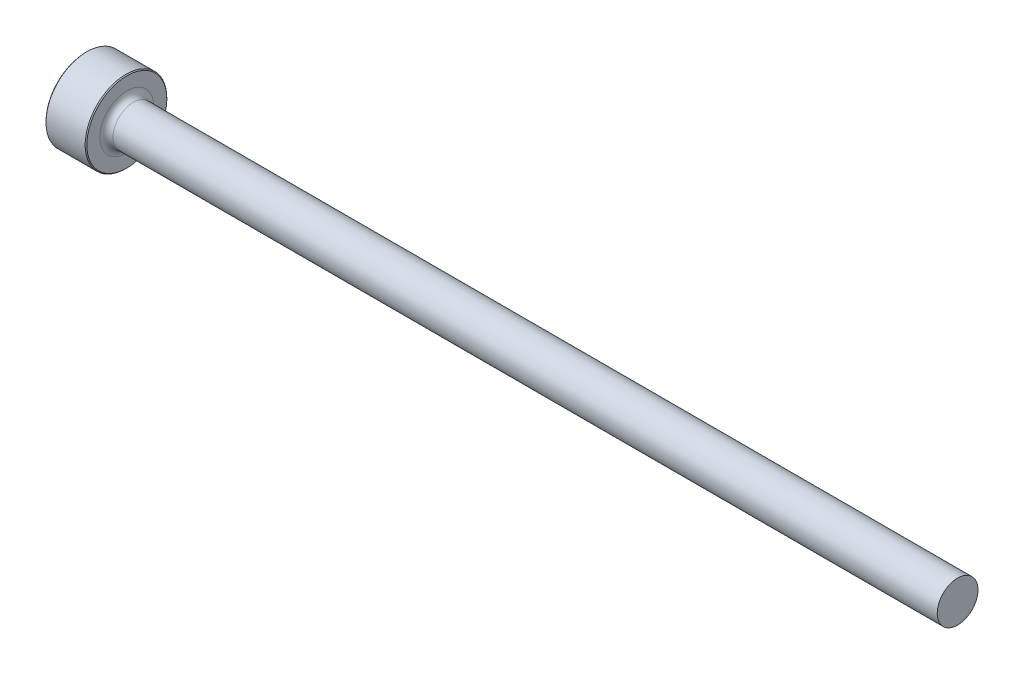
ISO-10303-21;
HEADER;
FILE_DESCRIPTION(('STEP AP214'),'2;1');
FILE_NAME('part.step','',(''),(''),'','','');
FILE_SCHEMA(('AUTOMOTIVE_DESIGN { 1 0 10303 214 1 1 1 1 }'));
ENDSEC;
DATA;
#1=APPLICATION_CONTEXT('core data for automotive mechanical design processes');
#2=APPLICATION_PROTOCOL_DEFINITION('international standard','automotive_design',2000,#1);
#3=PRODUCT_CONTEXT('',#1,'mechanical');
#4=PRODUCT('Part','Part','',(#3));
#5=PRODUCT_RELATED_PRODUCT_CATEGORY('part','',(#4));
#6=PRODUCT_DEFINITION_FORMATION('','',#4);
#7=PRODUCT_DEFINITION_CONTEXT('part definition',#1,'design');
#8=PRODUCT_DEFINITION('design','',#6,#7);
#9=PRODUCT_DEFINITION_SHAPE('','',#8);
#10=(LENGTH_UNIT() NAMED_UNIT(*) SI_UNIT(.MILLI.,.METRE.));
#11=(NAMED_UNIT(*) PLANE_ANGLE_UNIT() SI_UNIT($,.RADIAN.));
#12=(NAMED_UNIT(*) SI_UNIT($,.STERADIAN.) SOLID_ANGLE_UNIT());
#13=UNCERTAINTY_MEASURE_WITH_UNIT(LENGTH_MEASURE(1.E-05),#10,'distance_accuracy_value','');
#14=(GEOMETRIC_REPRESENTATION_CONTEXT(3) GLOBAL_UNCERTAINTY_ASSIGNED_CONTEXT((#13)) GLOBAL_UNIT_ASSIGNED_CONTEXT((#10,
#11,#12)) REPRESENTATION_CONTEXT('',''));
#15=CARTESIAN_POINT('',(0.,0.,0.));
#16=DIRECTION('',(0.,0.,1.));
#17=DIRECTION('',(1.,0.,0.));
#18=AXIS2_PLACEMENT_3D('',#15,#16,#17);
#19=CARTESIAN_POINT('',(101.6,2.37743999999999,0.));
#20=DIRECTION('',(1.,0.,0.));
#21=DIRECTION('',(0.,1.,0.));
#22=AXIS2_PLACEMENT_3D('',#19,#20,#21);
#23=PLANE('',#22);
#24=CARTESIAN_POINT('',(101.6,0.,0.));
#25=DIRECTION('',(1.,0.,0.));
#26=DIRECTION('',(0.,1.,0.));
#27=AXIS2_PLACEMENT_3D('',#24,#25,#26);
#28=CIRCLE('',#27,2.37744);
#29=CARTESIAN_POINT('',(101.6,2.37743999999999,0.));
#30=VERTEX_POINT('',#29);
#31=EDGE_CURVE('E50',#30,#30,#28,.T.);
#32=ORIENTED_EDGE('',*,*,#31,.T.);
#33=EDGE_LOOP('',(#32));
#34=FACE_BOUND('',#33,.T.);
#35=ADVANCED_FACE('F30',(#34),#23,.T.);
#36=CARTESIAN_POINT('',(101.6,0.,0.));
#37=DIRECTION('',(1.,0.,0.));
#38=DIRECTION('',(0.,1.,0.));
#39=AXIS2_PLACEMENT_3D('',#36,#37,#38);
#40=CYLINDRICAL_SURFACE('',#39,2.37744);
#41=CARTESIAN_POINT('',(5.5245,0.,0.));
#42=DIRECTION('',(1.,0.,0.));
#43=DIRECTION('',(0.,1.,0.));
#44=AXIS2_PLACEMENT_3D('',#41,#42,#43);
#45=CIRCLE('',#44,2.37743999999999);
#46=CARTESIAN_POINT('',(5.5245,2.37743999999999,0.));
#47=VERTEX_POINT('',#46);
#48=EDGE_CURVE('E53',#47,#47,#45,.T.);
#49=ORIENTED_EDGE('',*,*,#48,.T.);
#50=EDGE_LOOP('',(#49));
#51=FACE_BOUND('',#50,.T.);
#52=ORIENTED_EDGE('',*,*,#31,.F.);
#53=EDGE_LOOP('',(#52));
#54=FACE_BOUND('',#53,.T.);
#55=ADVANCED_FACE('F74',(#51,#54),#40,.T.);
#56=CARTESIAN_POINT('',(5.5245,0.,0.));
#57=DIRECTION('',(1.,0.,0.));
#58=DIRECTION('',(0.,1.,0.));
#59=AXIS2_PLACEMENT_3D('',#56,#57,#58);
#60=TOROIDAL_SURFACE('',#59,3.13943999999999,0.762);
#61=CARTESIAN_POINT('',(4.7625,0.,0.));
#62=DIRECTION('',(1.,0.,0.));
#63=DIRECTION('',(0.,1.,0.));
#64=AXIS2_PLACEMENT_3D('',#61,#62,#63);
#65=CIRCLE('',#64,3.13943999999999);
#66=CARTESIAN_POINT('',(4.7625,3.13943999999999,0.));
#67=VERTEX_POINT('',#66);
#68=EDGE_CURVE('E56',#67,#67,#65,.T.);
#69=ORIENTED_EDGE('',*,*,#68,.T.);
#70=EDGE_LOOP('',(#69));
#71=FACE_BOUND('',#70,.T.);
#72=ORIENTED_EDGE('',*,*,#48,.F.);
#73=EDGE_LOOP('',(#72));
#74=FACE_BOUND('',#73,.T.);
#75=ADVANCED_FACE('F60',(#71,#74),#60,.F.);
#76=CARTESIAN_POINT('',(4.7625,4.7625,0.));
#77=DIRECTION('',(1.,0.,0.));
#78=DIRECTION('',(0.,1.,0.));
#79=AXIS2_PLACEMENT_3D('',#76,#77,#78);
#80=PLANE('',#79);
#81=CARTESIAN_POINT('',(4.7625,0.,0.));
#82=DIRECTION('',(1.,0.,0.));
#83=DIRECTION('',(0.,1.,0.));
#84=AXIS2_PLACEMENT_3D('',#81,#82,#83);
#85=CIRCLE('',#84,4.6609);
#86=CARTESIAN_POINT('',(4.7625,4.6609,0.));
#87=VERTEX_POINT('',#86);
#88=EDGE_CURVE('E10',#87,#87,#85,.T.);
#89=ORIENTED_EDGE('',*,*,#88,.T.);
#90=EDGE_LOOP('',(#89));
#91=FACE_BOUND('',#90,.T.);
#92=ORIENTED_EDGE('',*,*,#68,.F.);
#93=EDGE_LOOP('',(#92));
#94=FACE_BOUND('',#93,.T.);
#95=ADVANCED_FACE('F63',(#91,#94),#80,.T.);
#96=CARTESIAN_POINT('',(101.6,0.,0.));
#97=DIRECTION('',(1.,0.,0.));
#98=DIRECTION('',(0.,1.,0.));
#99=AXIS2_PLACEMENT_3D('',#96,#97,#98);
#100=CYLINDRICAL_SURFACE('',#99,4.7625);
#101=CARTESIAN_POINT('',(0.101599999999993,0.,0.));
#102=DIRECTION('',(-1.,0.,0.));
#103=DIRECTION('',(0.,-1.,0.));
#104=AXIS2_PLACEMENT_3D('',#101,#102,#103);
#105=CIRCLE('',#104,4.7625);
#106=CARTESIAN_POINT('',(0.101599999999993,-4.7625,0.));
#107=VERTEX_POINT('',#106);
#108=EDGE_CURVE('E41',#107,#107,#105,.F.);
#109=ORIENTED_EDGE('',*,*,#108,.T.);
#110=EDGE_LOOP('',(#109));
#111=FACE_BOUND('',#110,.T.);
#112=CARTESIAN_POINT('',(4.66089999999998,0.,0.));
#113=DIRECTION('',(1.,0.,0.));
#114=DIRECTION('',(0.,1.,0.));
#115=AXIS2_PLACEMENT_3D('',#112,#113,#114);
#116=CIRCLE('',#115,4.7625);
#117=CARTESIAN_POINT('',(4.66089999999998,4.7625,0.));
#118=VERTEX_POINT('',#117);
#119=EDGE_CURVE('E45',#118,#118,#116,.F.);
#120=ORIENTED_EDGE('',*,*,#119,.T.);
#121=EDGE_LOOP('',(#120));
#122=FACE_BOUND('',#121,.T.);
#123=ADVANCED_FACE('F65',(#111,#122),#100,.T.);
#124=CARTESIAN_POINT('',(0.,0.,0.));
#125=DIRECTION('',(-1.,0.,0.));
#126=DIRECTION('',(0.,-1.,0.));
#127=AXIS2_PLACEMENT_3D('',#124,#125,#126);
#128=PLANE('',#127);
#129=CARTESIAN_POINT('',(0.,0.,0.));
#130=DIRECTION('',(-1.,0.,0.));
#131=DIRECTION('',(0.,-1.,0.));
#132=AXIS2_PLACEMENT_3D('',#129,#130,#131);
#133=CIRCLE('',#132,4.66089999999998);
#134=CARTESIAN_POINT('',(0.,-4.66089999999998,0.));
#135=VERTEX_POINT('',#134);
#136=EDGE_CURVE('E37',#135,#135,#133,.T.);
#137=ORIENTED_EDGE('',*,*,#136,.T.);
#138=EDGE_LOOP('',(#137));
#139=FACE_BOUND('',#138,.T.);
#140=ADVANCED_FACE('F71',(#139),#128,.T.);
#141=CARTESIAN_POINT('',(0.101599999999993,0.,0.));
#142=DIRECTION('',(1.,0.,0.));
#143=DIRECTION('',(0.,1.,0.));
#144=AXIS2_PLACEMENT_3D('',#141,#142,#143);
#145=CONICAL_SURFACE('',#144,4.7625,0.785398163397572);
#146=ORIENTED_EDGE('',*,*,#136,.F.);
#147=EDGE_LOOP('',(#146));
#148=FACE_BOUND('',#147,.T.);
#149=ORIENTED_EDGE('',*,*,#108,.F.);
#150=EDGE_LOOP('',(#149));
#151=FACE_BOUND('',#150,.T.);
#152=ADVANCED_FACE('F84',(#148,#151),#145,.T.);
#153=CARTESIAN_POINT('',(4.7625,0.,0.));
#154=DIRECTION('',(-1.,0.,0.));
#155=DIRECTION('',(0.,-1.,0.));
#156=AXIS2_PLACEMENT_3D('',#153,#154,#155);
#157=CONICAL_SURFACE('',#156,4.6609,0.785398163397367);
#158=ORIENTED_EDGE('',*,*,#119,.F.);
#159=EDGE_LOOP('',(#158));
#160=FACE_BOUND('',#159,.T.);
#161=ORIENTED_EDGE('',*,*,#88,.F.);
#162=EDGE_LOOP('',(#161));
#163=FACE_BOUND('',#162,.T.);
#164=ADVANCED_FACE('F32',(#160,#163),#157,.T.);
#165=CLOSED_SHELL('',(#35,#55,#75,#95,#123,#140,#152,#164));
#166=MANIFOLD_SOLID_BREP('B2',#165);
#167=ADVANCED_BREP_SHAPE_REPRESENTATION('',(#18,#166),#14);
#168=SHAPE_DEFINITION_REPRESENTATION(#9,#167);
ENDSEC;
END-ISO-10303-21;
